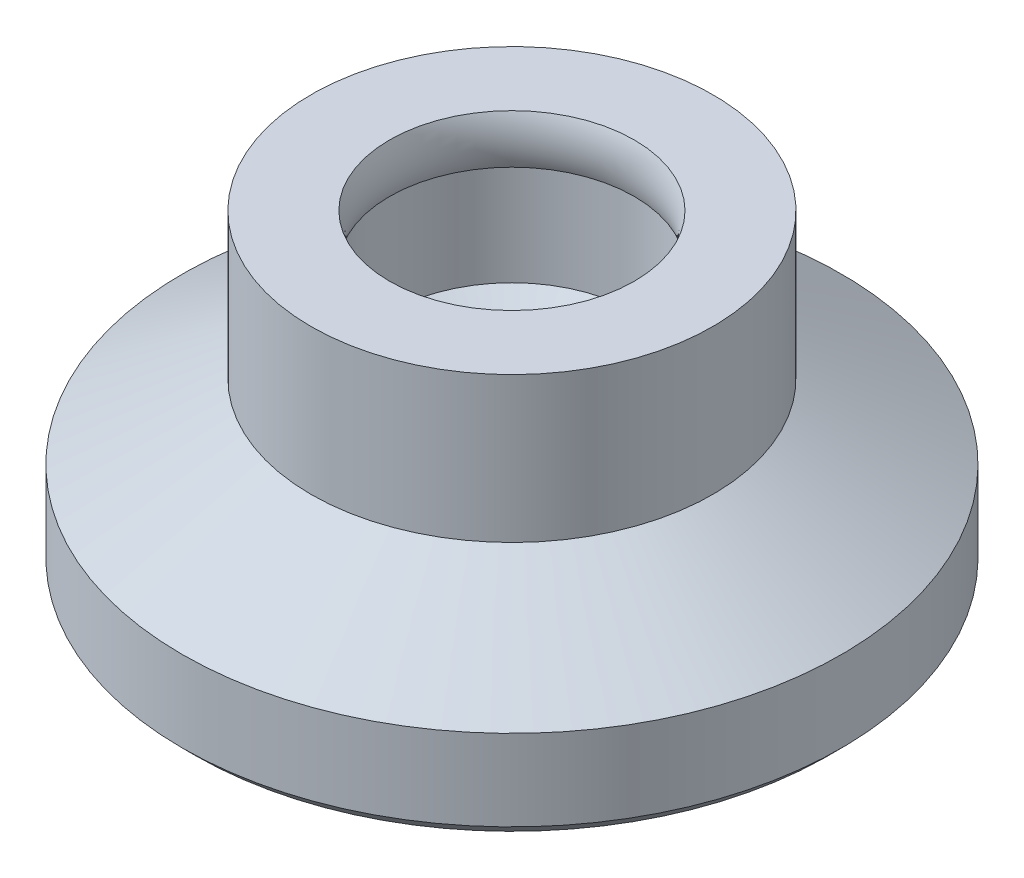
ISO-10303-21;
HEADER;
FILE_DESCRIPTION(('STEP AP214'),'2;1');
FILE_NAME('part.step','',(''),(''),'','','');
FILE_SCHEMA(('AUTOMOTIVE_DESIGN { 1 0 10303 214 1 1 1 1 }'));
ENDSEC;
DATA;
#1=APPLICATION_CONTEXT('core data for automotive mechanical design processes');
#2=APPLICATION_PROTOCOL_DEFINITION('international standard','automotive_design',2000,#1);
#3=PRODUCT_CONTEXT('',#1,'mechanical');
#4=PRODUCT('Part','Part','',(#3));
#5=PRODUCT_RELATED_PRODUCT_CATEGORY('part','',(#4));
#6=PRODUCT_DEFINITION_FORMATION('','',#4);
#7=PRODUCT_DEFINITION_CONTEXT('part definition',#1,'design');
#8=PRODUCT_DEFINITION('design','',#6,#7);
#9=PRODUCT_DEFINITION_SHAPE('','',#8);
#10=(LENGTH_UNIT() NAMED_UNIT(*) SI_UNIT(.MILLI.,.METRE.));
#11=(NAMED_UNIT(*) PLANE_ANGLE_UNIT() SI_UNIT($,.RADIAN.));
#12=(NAMED_UNIT(*) SI_UNIT($,.STERADIAN.) SOLID_ANGLE_UNIT());
#13=UNCERTAINTY_MEASURE_WITH_UNIT(LENGTH_MEASURE(1.E-05),#10,'distance_accuracy_value','');
#14=(GEOMETRIC_REPRESENTATION_CONTEXT(3) GLOBAL_UNCERTAINTY_ASSIGNED_CONTEXT((#13)) GLOBAL_UNIT_ASSIGNED_CONTEXT((#10,
#11,#12)) REPRESENTATION_CONTEXT('',''));
#15=CARTESIAN_POINT('',(0.,0.,0.));
#16=DIRECTION('',(0.,0.,1.));
#17=DIRECTION('',(1.,0.,0.));
#18=AXIS2_PLACEMENT_3D('',#15,#16,#17);
#19=CARTESIAN_POINT('',(0.,5.,0.));
#20=DIRECTION('',(0.,-1.,0.));
#21=DIRECTION('',(0.,0.,-1.));
#22=AXIS2_PLACEMENT_3D('',#19,#20,#21);
#23=CYLINDRICAL_SURFACE('',#22,6.4);
#24=CARTESIAN_POINT('',(0.,0.367136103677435,0.));
#25=DIRECTION('',(0.,1.,0.));
#26=DIRECTION('',(0.,0.,1.));
#27=AXIS2_PLACEMENT_3D('',#24,#25,#26);
#28=CIRCLE('',#27,6.4);
#29=CARTESIAN_POINT('',(0.,0.367136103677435,6.4));
#30=VERTEX_POINT('',#29);
#31=EDGE_CURVE('E91',#30,#30,#28,.T.);
#32=ORIENTED_EDGE('',*,*,#31,.T.);
#33=EDGE_LOOP('',(#32));
#34=FACE_BOUND('',#33,.T.);
#35=CARTESIAN_POINT('',(0.,5.,0.));
#36=DIRECTION('',(0.,1.,0.));
#37=DIRECTION('',(0.,0.,1.));
#38=AXIS2_PLACEMENT_3D('',#35,#36,#37);
#39=CIRCLE('',#38,6.4);
#40=CARTESIAN_POINT('',(0.,5.,6.4));
#41=VERTEX_POINT('',#40);
#42=EDGE_CURVE('E93',#41,#41,#39,.T.);
#43=ORIENTED_EDGE('',*,*,#42,.F.);
#44=EDGE_LOOP('',(#43));
#45=FACE_BOUND('',#44,.T.);
#46=ADVANCED_FACE('F37',(#34,#45),#23,.T.);
#47=CARTESIAN_POINT('',(0.,5.,0.));
#48=DIRECTION('',(0.,1.,0.));
#49=DIRECTION('',(0.,0.,1.));
#50=AXIS2_PLACEMENT_3D('',#47,#48,#49);
#51=PLANE('',#50);
#52=CARTESIAN_POINT('',(0.,5.,0.));
#53=DIRECTION('',(0.,-1.,0.));
#54=DIRECTION('',(0.,0.,-1.));
#55=AXIS2_PLACEMENT_3D('',#52,#53,#54);
#56=CIRCLE('',#55,3.9);
#57=CARTESIAN_POINT('',(0.,5.,-3.9));
#58=VERTEX_POINT('',#57);
#59=EDGE_CURVE('E110',#58,#58,#56,.T.);
#60=ORIENTED_EDGE('',*,*,#59,.T.);
#61=EDGE_LOOP('',(#60));
#62=FACE_BOUND('',#61,.T.);
#63=ORIENTED_EDGE('',*,*,#42,.T.);
#64=EDGE_LOOP('',(#63));
#65=FACE_BOUND('',#64,.T.);
#66=ADVANCED_FACE('F65',(#62,#65),#51,.T.);
#67=CARTESIAN_POINT('',(0.,0.367136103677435,0.));
#68=DIRECTION('',(0.,-1.,0.));
#69=DIRECTION('',(0.,0.,-1.));
#70=AXIS2_PLACEMENT_3D('',#67,#68,#69);
#71=CONICAL_SURFACE('',#70,6.4,1.0471975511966);
#72=CARTESIAN_POINT('',(0.,-2.,0.));
#73=DIRECTION('',(0.,1.,0.));
#74=DIRECTION('',(0.,0.,1.));
#75=AXIS2_PLACEMENT_3D('',#72,#73,#74);
#76=CIRCLE('',#75,10.5);
#77=CARTESIAN_POINT('',(0.,-2.,10.5));
#78=VERTEX_POINT('',#77);
#79=EDGE_CURVE('E89',#78,#78,#76,.T.);
#80=ORIENTED_EDGE('',*,*,#79,.T.);
#81=EDGE_LOOP('',(#80));
#82=FACE_BOUND('',#81,.T.);
#83=ORIENTED_EDGE('',*,*,#31,.F.);
#84=EDGE_LOOP('',(#83));
#85=FACE_BOUND('',#84,.T.);
#86=ADVANCED_FACE('F70',(#82,#85),#71,.T.);
#87=CARTESIAN_POINT('',(0.,-5.,0.));
#88=DIRECTION('',(0.,1.,0.));
#89=DIRECTION('',(0.,0.,1.));
#90=AXIS2_PLACEMENT_3D('',#87,#88,#89);
#91=PLANE('',#90);
#92=CARTESIAN_POINT('',(0.,-5.,0.));
#93=DIRECTION('',(0.,1.,0.));
#94=DIRECTION('',(0.,0.,1.));
#95=AXIS2_PLACEMENT_3D('',#92,#93,#94);
#96=CIRCLE('',#95,10.08);
#97=CARTESIAN_POINT('',(0.,-5.,10.08));
#98=VERTEX_POINT('',#97);
#99=EDGE_CURVE('E45',#98,#98,#96,.F.);
#100=ORIENTED_EDGE('',*,*,#99,.T.);
#101=EDGE_LOOP('',(#100));
#102=FACE_BOUND('',#101,.T.);
#103=ADVANCED_FACE('F76',(#102),#91,.F.);
#104=CARTESIAN_POINT('',(0.,-2.,0.));
#105=DIRECTION('',(0.,-1.,0.));
#106=DIRECTION('',(0.,0.,-1.));
#107=AXIS2_PLACEMENT_3D('',#104,#105,#106);
#108=CYLINDRICAL_SURFACE('',#107,10.5);
#109=CARTESIAN_POINT('',(0.,-4.57999999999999,0.));
#110=DIRECTION('',(0.,1.,0.));
#111=DIRECTION('',(0.,0.,1.));
#112=AXIS2_PLACEMENT_3D('',#109,#110,#111);
#113=CIRCLE('',#112,10.5);
#114=CARTESIAN_POINT('',(0.,-4.57999999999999,10.5));
#115=VERTEX_POINT('',#114);
#116=EDGE_CURVE('E11',#115,#115,#113,.T.);
#117=ORIENTED_EDGE('',*,*,#116,.T.);
#118=EDGE_LOOP('',(#117));
#119=FACE_BOUND('',#118,.T.);
#120=ORIENTED_EDGE('',*,*,#79,.F.);
#121=EDGE_LOOP('',(#120));
#122=FACE_BOUND('',#121,.T.);
#123=ADVANCED_FACE('F60',(#119,#122),#108,.T.);
#124=CARTESIAN_POINT('',(0.,-5.,0.));
#125=DIRECTION('',(0.,1.,0.));
#126=DIRECTION('',(0.,0.,1.));
#127=AXIS2_PLACEMENT_3D('',#124,#125,#126);
#128=CONICAL_SURFACE('',#127,10.08,0.785398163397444);
#129=CARTESIAN_POINT('',(0.,-4.57999999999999,10.5));
#130=CARTESIAN_POINT('',(0.,-4.58437499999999,10.495625));
#131=CARTESIAN_POINT('',(0.,-4.58874999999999,10.49125));
#132=CARTESIAN_POINT('',(0.,-4.59749999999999,10.4825));
#133=CARTESIAN_POINT('',(0.,-4.60187499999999,10.478125));
#134=CARTESIAN_POINT('',(0.,-4.61062499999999,10.469375));
#135=CARTESIAN_POINT('',(0.,-4.61499999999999,10.465));
#136=CARTESIAN_POINT('',(0.,-4.62374999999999,10.45625));
#137=CARTESIAN_POINT('',(0.,-4.62812499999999,10.451875));
#138=CARTESIAN_POINT('',(0.,-4.63687499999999,10.443125));
#139=CARTESIAN_POINT('',(0.,-4.64124999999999,10.43875));
#140=CARTESIAN_POINT('',(0.,-4.64999999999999,10.43));
#141=CARTESIAN_POINT('',(0.,-4.65437499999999,10.425625));
#142=CARTESIAN_POINT('',(0.,-4.66312499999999,10.416875));
#143=CARTESIAN_POINT('',(0.,-4.66749999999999,10.4125));
#144=CARTESIAN_POINT('',(0.,-4.67624999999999,10.40375));
#145=CARTESIAN_POINT('',(0.,-4.68062499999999,10.399375));
#146=CARTESIAN_POINT('',(0.,-4.68937499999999,10.390625));
#147=CARTESIAN_POINT('',(0.,-4.69374999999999,10.38625));
#148=CARTESIAN_POINT('',(0.,-4.70249999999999,10.3775));
#149=CARTESIAN_POINT('',(0.,-4.70687499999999,10.373125));
#150=CARTESIAN_POINT('',(0.,-4.71562499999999,10.364375));
#151=CARTESIAN_POINT('',(0.,-4.72,10.36));
#152=CARTESIAN_POINT('',(0.,-4.72875,10.35125));
#153=CARTESIAN_POINT('',(0.,-4.73312499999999,10.346875));
#154=CARTESIAN_POINT('',(0.,-4.74187499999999,10.338125));
#155=CARTESIAN_POINT('',(0.,-4.74625,10.33375));
#156=CARTESIAN_POINT('',(0.,-4.755,10.325));
#157=CARTESIAN_POINT('',(0.,-4.759375,10.320625));
#158=CARTESIAN_POINT('',(0.,-4.768125,10.311875));
#159=CARTESIAN_POINT('',(0.,-4.7725,10.3075));
#160=CARTESIAN_POINT('',(0.,-4.78125,10.29875));
#161=CARTESIAN_POINT('',(0.,-4.785625,10.294375));
#162=CARTESIAN_POINT('',(0.,-4.794375,10.285625));
#163=CARTESIAN_POINT('',(0.,-4.79875,10.28125));
#164=CARTESIAN_POINT('',(0.,-4.8075,10.2725));
#165=CARTESIAN_POINT('',(0.,-4.811875,10.268125));
#166=CARTESIAN_POINT('',(0.,-4.820625,10.259375));
#167=CARTESIAN_POINT('',(0.,-4.825,10.255));
#168=CARTESIAN_POINT('',(0.,-4.83375,10.24625));
#169=CARTESIAN_POINT('',(0.,-4.838125,10.241875));
#170=CARTESIAN_POINT('',(0.,-4.846875,10.233125));
#171=CARTESIAN_POINT('',(0.,-4.85125,10.22875));
#172=CARTESIAN_POINT('',(0.,-4.86,10.22));
#173=CARTESIAN_POINT('',(0.,-4.864375,10.215625));
#174=CARTESIAN_POINT('',(0.,-4.873125,10.206875));
#175=CARTESIAN_POINT('',(0.,-4.8775,10.2025));
#176=CARTESIAN_POINT('',(0.,-4.88625,10.19375));
#177=CARTESIAN_POINT('',(0.,-4.890625,10.189375));
#178=CARTESIAN_POINT('',(0.,-4.899375,10.180625));
#179=CARTESIAN_POINT('',(0.,-4.90375,10.17625));
#180=CARTESIAN_POINT('',(0.,-4.9125,10.1675));
#181=CARTESIAN_POINT('',(0.,-4.916875,10.163125));
#182=CARTESIAN_POINT('',(0.,-4.925625,10.154375));
#183=CARTESIAN_POINT('',(0.,-4.93,10.15));
#184=CARTESIAN_POINT('',(0.,-4.93875,10.14125));
#185=CARTESIAN_POINT('',(0.,-4.943125,10.136875));
#186=CARTESIAN_POINT('',(0.,-4.951875,10.128125));
#187=CARTESIAN_POINT('',(0.,-4.95625,10.12375));
#188=CARTESIAN_POINT('',(0.,-4.965,10.115));
#189=CARTESIAN_POINT('',(0.,-4.969375,10.110625));
#190=CARTESIAN_POINT('',(0.,-4.978125,10.101875));
#191=CARTESIAN_POINT('',(0.,-4.9825,10.0975));
#192=CARTESIAN_POINT('',(0.,-4.99125,10.08875));
#193=CARTESIAN_POINT('',(0.,-4.995625,10.084375));
#194=CARTESIAN_POINT('',(0.,-5.,10.08));
#195=B_SPLINE_CURVE_WITH_KNOTS('',3,(#129,#130,#131,#132,#133,#134,#135,#136,#137,#138,#139,
#140,#141,#142,#143,#144,#145,#146,#147,#148,#149,#150,#151,#152,#153,#154,#155,#156,#157,#158,
#159,#160,#161,#162,#163,#164,#165,#166,#167,#168,#169,#170,#171,#172,#173,#174,#175,#176,#177,
#178,#179,#180,#181,#182,#183,#184,#185,#186,#187,#188,#189,#190,#191,#192,#193,#194),
.UNSPECIFIED.,.F.,.F.,(4,2,2,2,2,2,2,2,2,2,2,2,2,2,2,2,2,2,2,2,2,2,2,2,2,2,2,2,2,2,2,2,4),(0.,
0.0185615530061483,0.0371231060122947,0.0556846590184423,0.0742462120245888,0.0928077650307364,
0.111369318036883,0.129930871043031,0.148492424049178,0.167053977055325,0.185615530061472,
0.20417708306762,0.222738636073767,0.241300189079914,0.259861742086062,0.278423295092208,
0.296984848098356,0.315546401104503,0.33410795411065,0.352669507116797,0.371231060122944,
0.389792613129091,0.408354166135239,0.426915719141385,0.445477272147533,0.464038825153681,
0.482600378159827,0.501161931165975,0.519723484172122,0.53828503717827,0.556846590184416,
0.575408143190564,0.59396969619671),.UNSPECIFIED.);
#196=EDGE_CURVE('BSEAM39',#115,#98,#195,.T.);
#197=ORIENTED_EDGE('',*,*,#116,.F.);
#198=ORIENTED_EDGE('',*,*,#99,.F.);
#199=ORIENTED_EDGE('',*,*,#196,.T.);
#200=ORIENTED_EDGE('',*,*,#196,.F.);
#201=EDGE_LOOP('',(#197,#199,#198,#200));
#202=FACE_BOUND('',#201,.T.);
#203=ADVANCED_FACE('F39',(#202),#128,.T.);
#204=CARTESIAN_POINT('',(0.,-2.,0.));
#205=DIRECTION('',(0.,1.,0.));
#206=DIRECTION('',(0.,0.,1.));
#207=AXIS2_PLACEMENT_3D('',#204,#205,#206);
#208=CONICAL_SURFACE('',#207,0.,1.04719755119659);
#209=CARTESIAN_POINT('',(0.,0.251666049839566,0.));
#210=DIRECTION('',(0.,-1.,0.));
#211=DIRECTION('',(0.,0.,-1.));
#212=AXIS2_PLACEMENT_3D('',#209,#210,#211);
#213=CIRCLE('',#212,3.9);
#214=CARTESIAN_POINT('',(0.,0.251666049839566,-3.9));
#215=VERTEX_POINT('',#214);
#216=EDGE_CURVE('E101',#215,#215,#213,.T.);
#217=ORIENTED_EDGE('',*,*,#216,.F.);
#218=EDGE_LOOP('',(#217));
#219=FACE_BOUND('',#218,.T.);
#220=CARTESIAN_POINT('',(0.,-2.,0.));
#221=VERTEX_POINT('',#220);
#222=VERTEX_LOOP('',#221);
#223=FACE_BOUND('',#222,.T.);
#224=ADVANCED_FACE('F48',(#219,#223),#208,.F.);
#225=CARTESIAN_POINT('',(0.,0.,0.));
#226=DIRECTION('',(0.,-1.,0.));
#227=DIRECTION('',(0.,0.,-1.));
#228=AXIS2_PLACEMENT_3D('',#225,#226,#227);
#229=CYLINDRICAL_SURFACE('',#228,3.9);
#230=CARTESIAN_POINT('',(0.,3.44,0.));
#231=DIRECTION('',(0.,-1.,0.));
#232=DIRECTION('',(0.,0.,-1.));
#233=AXIS2_PLACEMENT_3D('',#230,#231,#232);
#234=CIRCLE('',#233,3.9);
#235=CARTESIAN_POINT('',(0.,3.44,-3.9));
#236=VERTEX_POINT('',#235);
#237=EDGE_CURVE('E109',#236,#236,#234,.T.);
#238=ORIENTED_EDGE('',*,*,#237,.F.);
#239=EDGE_LOOP('',(#238));
#240=FACE_BOUND('',#239,.T.);
#241=ORIENTED_EDGE('',*,*,#216,.T.);
#242=EDGE_LOOP('',(#241));
#243=FACE_BOUND('',#242,.T.);
#244=ADVANCED_FACE('F50',(#240,#243),#229,.F.);
#245=CARTESIAN_POINT('',(0.,4.22,0.));
#246=DIRECTION('',(0.,-1.,0.));
#247=DIRECTION('',(0.,0.,-1.));
#248=AXIS2_PLACEMENT_3D('',#245,#246,#247);
#249=TOROIDAL_SURFACE('',#248,5.77199999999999,2.02799999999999);
#250=ORIENTED_EDGE('',*,*,#59,.F.);
#251=EDGE_LOOP('',(#250));
#252=FACE_BOUND('',#251,.T.);
#253=ORIENTED_EDGE('',*,*,#237,.T.);
#254=EDGE_LOOP('',(#253));
#255=FACE_BOUND('',#254,.T.);
#256=ADVANCED_FACE('F57',(#252,#255),#249,.T.);
#257=CLOSED_SHELL('',(#46,#66,#86,#103,#123,#203,#224,#244,#256));
#258=MANIFOLD_SOLID_BREP('B2',#257);
#259=ADVANCED_BREP_SHAPE_REPRESENTATION('',(#18,#258),#14);
#260=SHAPE_DEFINITION_REPRESENTATION(#9,#259);
ENDSEC;
END-ISO-10303-21;
